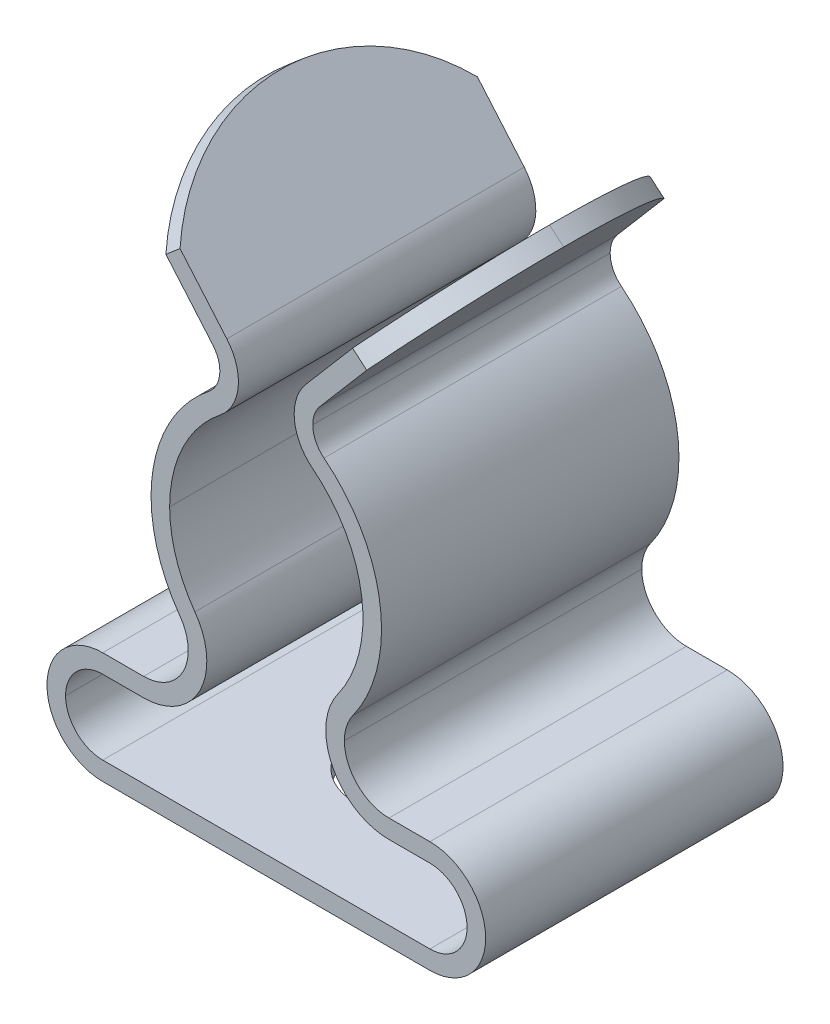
ISO-10303-21;
HEADER;
FILE_DESCRIPTION(('STEP AP214'),'2;1');
FILE_NAME('part.step','',(''),(''),'','','');
FILE_SCHEMA(('AUTOMOTIVE_DESIGN { 1 0 10303 214 1 1 1 1 }'));
ENDSEC;
DATA;
#1=APPLICATION_CONTEXT('core data for automotive mechanical design processes');
#2=APPLICATION_PROTOCOL_DEFINITION('international standard','automotive_design',2000,#1);
#3=PRODUCT_CONTEXT('',#1,'mechanical');
#4=PRODUCT('Part','Part','',(#3));
#5=PRODUCT_RELATED_PRODUCT_CATEGORY('part','',(#4));
#6=PRODUCT_DEFINITION_FORMATION('','',#4);
#7=PRODUCT_DEFINITION_CONTEXT('part definition',#1,'design');
#8=PRODUCT_DEFINITION('design','',#6,#7);
#9=PRODUCT_DEFINITION_SHAPE('','',#8);
#10=(LENGTH_UNIT() NAMED_UNIT(*) SI_UNIT(.MILLI.,.METRE.));
#11=(NAMED_UNIT(*) PLANE_ANGLE_UNIT() SI_UNIT($,.RADIAN.));
#12=(NAMED_UNIT(*) SI_UNIT($,.STERADIAN.) SOLID_ANGLE_UNIT());
#13=UNCERTAINTY_MEASURE_WITH_UNIT(LENGTH_MEASURE(1.E-05),#10,'distance_accuracy_value','');
#14=(GEOMETRIC_REPRESENTATION_CONTEXT(3) GLOBAL_UNCERTAINTY_ASSIGNED_CONTEXT((#13)) GLOBAL_UNIT_ASSIGNED_CONTEXT((#10,
#11,#12)) REPRESENTATION_CONTEXT('',''));
#15=CARTESIAN_POINT('',(0.,0.,0.));
#16=DIRECTION('',(0.,0.,1.));
#17=DIRECTION('',(1.,0.,0.));
#18=AXIS2_PLACEMENT_3D('',#15,#16,#17);
#19=CARTESIAN_POINT('',(0.,0.,4.));
#20=DIRECTION('',(0.,-1.,0.));
#21=DIRECTION('',(0.,0.,-1.));
#22=AXIS2_PLACEMENT_3D('',#19,#20,#21);
#23=CYLINDRICAL_SURFACE('',#22,1.6);
#24=DIRECTION('',(0.,-1.,0.));
#25=VECTOR('',#24,1.);
#26=CARTESIAN_POINT('',(0.,0.,5.6));
#27=LINE('',#26,#25);
#28=CARTESIAN_POINT('',(0.,0.5,5.6));
#29=VERTEX_POINT('',#28);
#30=CARTESIAN_POINT('',(0.,0.,5.6));
#31=VERTEX_POINT('',#30);
#32=EDGE_CURVE('E355',#29,#31,#27,.T.);
#33=ORIENTED_EDGE('',*,*,#32,.F.);
#34=CARTESIAN_POINT('',(0.,0.5,4.));
#35=DIRECTION('',(0.,1.,0.));
#36=DIRECTION('',(0.,0.,1.));
#37=AXIS2_PLACEMENT_3D('',#34,#35,#36);
#38=CIRCLE('',#37,1.6);
#39=CARTESIAN_POINT('',(0.,0.5,2.4));
#40=VERTEX_POINT('',#39);
#41=EDGE_CURVE('E350',#29,#40,#38,.T.);
#42=ORIENTED_EDGE('',*,*,#41,.T.);
#43=DIRECTION('',(0.,-1.,0.));
#44=VECTOR('',#43,1.);
#45=CARTESIAN_POINT('',(0.,0.,2.4));
#46=LINE('',#45,#44);
#47=CARTESIAN_POINT('',(0.,0.,2.4));
#48=VERTEX_POINT('',#47);
#49=EDGE_CURVE('E352',#40,#48,#46,.T.);
#50=ORIENTED_EDGE('',*,*,#49,.T.);
#51=CARTESIAN_POINT('',(0.,0.,4.));
#52=DIRECTION('',(0.,-1.,0.));
#53=DIRECTION('',(0.,0.,-1.));
#54=AXIS2_PLACEMENT_3D('',#51,#52,#53);
#55=CIRCLE('',#54,1.6);
#56=EDGE_CURVE('E772',#48,#31,#55,.T.);
#57=ORIENTED_EDGE('',*,*,#56,.T.);
#58=EDGE_LOOP('',(#33,#42,#50,#57));
#59=FACE_BOUND('',#58,.T.);
#60=ADVANCED_FACE('F15',(#59),#23,.F.);
#61=CARTESIAN_POINT('',(5.13195390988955,15.8764094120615,4.));
#62=DIRECTION('',(-0.76040596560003,-0.649448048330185,0.));
#63=DIRECTION('',(0.649448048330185,-0.76040596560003,0.));
#64=AXIS2_PLACEMENT_3D('',#61,#62,#63);
#65=CYLINDRICAL_SURFACE('',#64,5.);
#66=CARTESIAN_POINT('',(-0.372556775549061,11.1751131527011,4.));
#67=DIRECTION('',(-0.76040596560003,-0.649448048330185,0.));
#68=DIRECTION('',(-0.649448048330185,0.76040596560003,0.));
#69=AXIS2_PLACEMENT_3D('',#66,#67,#68);
#70=CIRCLE('',#69,5.);
#71=CARTESIAN_POINT('',(-2.32090092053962,13.4563310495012,8.));
#72=VERTEX_POINT('',#71);
#73=CARTESIAN_POINT('',(-2.32090092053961,13.4563310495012,0.));
#74=VERTEX_POINT('',#73);
#75=EDGE_CURVE('E436',#72,#74,#70,.T.);
#76=ORIENTED_EDGE('',*,*,#75,.T.);
#77=DIRECTION('',(-0.76040596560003,-0.649448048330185,0.));
#78=VECTOR('',#77,1.);
#79=CARTESIAN_POINT('',(3.18360976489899,18.1576273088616,0.));
#80=LINE('',#79,#78);
#81=CARTESIAN_POINT('',(-2.70110390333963,13.1316070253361,0.));
#82=VERTEX_POINT('',#81);
#83=EDGE_CURVE('E722',#74,#82,#80,.T.);
#84=ORIENTED_EDGE('',*,*,#83,.T.);
#85=CARTESIAN_POINT('',(-0.752759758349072,10.850389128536,4.));
#86=DIRECTION('',(0.76040596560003,0.649448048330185,0.));
#87=DIRECTION('',(0.649448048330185,-0.76040596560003,0.));
#88=AXIS2_PLACEMENT_3D('',#85,#86,#87);
#89=CIRCLE('',#88,5.);
#90=CARTESIAN_POINT('',(-2.70110390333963,13.1316070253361,8.));
#91=VERTEX_POINT('',#90);
#92=EDGE_CURVE('E630',#82,#91,#89,.T.);
#93=ORIENTED_EDGE('',*,*,#92,.T.);
#94=DIRECTION('',(-0.76040596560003,-0.649448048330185,0.));
#95=VECTOR('',#94,1.);
#96=CARTESIAN_POINT('',(3.18360976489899,18.1576273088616,8.));
#97=LINE('',#96,#95);
#98=EDGE_CURVE('E477',#72,#91,#97,.T.);
#99=ORIENTED_EDGE('',*,*,#98,.F.);
#100=EDGE_LOOP('',(#76,#84,#93,#99));
#101=FACE_BOUND('',#100,.T.);
#102=ADVANCED_FACE('F842',(#101),#65,.T.);
#103=CARTESIAN_POINT('',(-5.13195390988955,15.8764094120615,4.));
#104=DIRECTION('',(0.76040596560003,-0.649448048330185,0.));
#105=DIRECTION('',(0.649448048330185,0.76040596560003,0.));
#106=AXIS2_PLACEMENT_3D('',#103,#104,#105);
#107=CYLINDRICAL_SURFACE('',#106,5.);
#108=DIRECTION('',(0.76040596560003,-0.649448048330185,0.));
#109=VECTOR('',#108,1.);
#110=CARTESIAN_POINT('',(-1.88471366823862,19.6784392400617,4.));
#111=LINE('',#110,#109);
#112=CARTESIAN_POINT('',(3.61979701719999,14.9771429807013,4.));
#113=VERTEX_POINT('',#112);
#114=CARTESIAN_POINT('',(4.,14.6524189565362,4.));
#115=VERTEX_POINT('',#114);
#116=EDGE_CURVE('E410',#113,#115,#111,.T.);
#117=ORIENTED_EDGE('',*,*,#116,.F.);
#118=CARTESIAN_POINT('',(0.372556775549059,11.1751131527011,4.));
#119=DIRECTION('',(0.76040596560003,-0.649448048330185,0.));
#120=DIRECTION('',(-0.649448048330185,-0.76040596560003,0.));
#121=AXIS2_PLACEMENT_3D('',#118,#119,#120);
#122=CIRCLE('',#121,5.);
#123=CARTESIAN_POINT('',(2.32090092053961,13.4563310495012,8.));
#124=VERTEX_POINT('',#123);
#125=EDGE_CURVE('E719',#113,#124,#122,.T.);
#126=ORIENTED_EDGE('',*,*,#125,.T.);
#127=DIRECTION('',(0.76040596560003,-0.649448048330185,0.));
#128=VECTOR('',#127,1.);
#129=CARTESIAN_POINT('',(-3.18360976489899,18.1576273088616,8.));
#130=LINE('',#129,#128);
#131=CARTESIAN_POINT('',(2.70110390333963,13.1316070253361,8.));
#132=VERTEX_POINT('',#131);
#133=EDGE_CURVE('E554',#124,#132,#130,.T.);
#134=ORIENTED_EDGE('',*,*,#133,.T.);
#135=CARTESIAN_POINT('',(0.752759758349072,10.850389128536,4.));
#136=DIRECTION('',(-0.76040596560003,0.649448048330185,0.));
#137=DIRECTION('',(-0.649448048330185,-0.76040596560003,0.));
#138=AXIS2_PLACEMENT_3D('',#135,#136,#137);
#139=CIRCLE('',#138,5.);
#140=EDGE_CURVE('E709',#132,#115,#139,.T.);
#141=ORIENTED_EDGE('',*,*,#140,.T.);
#142=EDGE_LOOP('',(#117,#126,#134,#141));
#143=FACE_BOUND('',#142,.T.);
#144=ADVANCED_FACE('F930',(#143),#107,.T.);
#145=CARTESIAN_POINT('',(2.05,11.1374470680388,8.));
#146=DIRECTION('',(0.,0.,-1.));
#147=DIRECTION('',(-1.,0.,0.));
#148=AXIS2_PLACEMENT_3D('',#145,#146,#147);
#149=CYLINDRICAL_SURFACE('',#148,0.8);
#150=DIRECTION('',(0.,0.,-1.));
#151=VECTOR('',#150,1.);
#152=CARTESIAN_POINT('',(1.25,11.1374470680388,8.));
#153=LINE('',#152,#151);
#154=CARTESIAN_POINT('',(1.25,11.1374470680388,8.));
#155=VERTEX_POINT('',#154);
#156=CARTESIAN_POINT('',(1.25,11.1374470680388,0.));
#157=VERTEX_POINT('',#156);
#158=EDGE_CURVE('E390',#155,#157,#153,.T.);
#159=ORIENTED_EDGE('',*,*,#158,.F.);
#160=CARTESIAN_POINT('',(2.05,11.1374470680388,8.));
#161=DIRECTION('',(0.,0.,-1.));
#162=DIRECTION('',(-1.,0.,0.));
#163=AXIS2_PLACEMENT_3D('',#160,#161,#162);
#164=CIRCLE('',#163,0.8);
#165=CARTESIAN_POINT('',(1.55173292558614,10.5115637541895,8.));
#166=VERTEX_POINT('',#165);
#167=EDGE_CURVE('E555',#166,#155,#164,.T.);
#168=ORIENTED_EDGE('',*,*,#167,.F.);
#169=DIRECTION('',(0.,0.,-1.));
#170=VECTOR('',#169,1.);
#171=CARTESIAN_POINT('',(1.55173292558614,10.5115637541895,8.));
#172=LINE('',#171,#170);
#173=CARTESIAN_POINT('',(1.55173292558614,10.5115637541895,0.));
#174=VERTEX_POINT('',#173);
#175=EDGE_CURVE('E9',#166,#174,#172,.T.);
#176=ORIENTED_EDGE('',*,*,#175,.T.);
#177=CARTESIAN_POINT('',(2.05,11.1374470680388,0.));
#178=DIRECTION('',(0.,0.,-1.));
#179=DIRECTION('',(-1.,0.,0.));
#180=AXIS2_PLACEMENT_3D('',#177,#178,#179);
#181=CIRCLE('',#180,0.8);
#182=EDGE_CURVE('E740',#174,#157,#181,.T.);
#183=ORIENTED_EDGE('',*,*,#182,.T.);
#184=EDGE_LOOP('',(#159,#168,#176,#183));
#185=FACE_BOUND('',#184,.T.);
#186=ADVANCED_FACE('F919',(#185),#149,.F.);
#187=CARTESIAN_POINT('',(-1.005,7.3,8.));
#188=DIRECTION('',(0.,0.,-1.));
#189=DIRECTION('',(-1.,0.,0.));
#190=AXIS2_PLACEMENT_3D('',#187,#188,#189);
#191=CYLINDRICAL_SURFACE('',#190,4.105);
#192=CARTESIAN_POINT('',(-1.005,7.3,0.));
#193=DIRECTION('',(0.,0.,1.));
#194=DIRECTION('',(1.,0.,0.));
#195=AXIS2_PLACEMENT_3D('',#192,#193,#194);
#196=CIRCLE('',#195,4.105);
#197=CARTESIAN_POINT('',(2.32620169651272,4.90122525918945,0.));
#198=VERTEX_POINT('',#197);
#199=EDGE_CURVE('E743',#198,#174,#196,.T.);
#200=ORIENTED_EDGE('',*,*,#199,.T.);
#201=ORIENTED_EDGE('',*,*,#175,.F.);
#202=CARTESIAN_POINT('',(-1.005,7.3,8.));
#203=DIRECTION('',(0.,0.,1.));
#204=DIRECTION('',(1.,0.,0.));
#205=AXIS2_PLACEMENT_3D('',#202,#203,#204);
#206=CIRCLE('',#205,4.105);
#207=CARTESIAN_POINT('',(2.32620169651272,4.90122525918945,8.));
#208=VERTEX_POINT('',#207);
#209=EDGE_CURVE('E535',#208,#166,#206,.T.);
#210=ORIENTED_EDGE('',*,*,#209,.F.);
#211=DIRECTION('',(0.,0.,-1.));
#212=VECTOR('',#211,1.);
#213=CARTESIAN_POINT('',(2.32620169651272,4.90122525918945,8.));
#214=LINE('',#213,#212);
#215=EDGE_CURVE('E445',#208,#198,#214,.T.);
#216=ORIENTED_EDGE('',*,*,#215,.T.);
#217=EDGE_LOOP('',(#200,#201,#210,#216));
#218=FACE_BOUND('',#217,.T.);
#219=ADVANCED_FACE('F921',(#218),#191,.T.);
#220=CARTESIAN_POINT('',(3.3,4.2,8.));
#221=DIRECTION('',(0.,0.,-1.));
#222=DIRECTION('',(-1.,0.,0.));
#223=AXIS2_PLACEMENT_3D('',#220,#221,#222);
#224=CYLINDRICAL_SURFACE('',#223,1.2);
#225=DIRECTION('',(0.,0.,-1.));
#226=VECTOR('',#225,1.);
#227=CARTESIAN_POINT('',(2.1,4.2,8.));
#228=LINE('',#227,#226);
#229=CARTESIAN_POINT('',(2.1,4.2,8.));
#230=VERTEX_POINT('',#229);
#231=CARTESIAN_POINT('',(2.1,4.2,0.));
#232=VERTEX_POINT('',#231);
#233=EDGE_CURVE('E420',#230,#232,#228,.T.);
#234=ORIENTED_EDGE('',*,*,#233,.F.);
#235=CARTESIAN_POINT('',(3.3,4.2,8.));
#236=DIRECTION('',(0.,0.,-1.));
#237=DIRECTION('',(-1.,0.,0.));
#238=AXIS2_PLACEMENT_3D('',#235,#236,#237);
#239=CIRCLE('',#238,1.2);
#240=CARTESIAN_POINT('',(3.3,3.,8.));
#241=VERTEX_POINT('',#240);
#242=EDGE_CURVE('E528',#241,#230,#239,.T.);
#243=ORIENTED_EDGE('',*,*,#242,.F.);
#244=DIRECTION('',(0.,0.,-1.));
#245=VECTOR('',#244,1.);
#246=CARTESIAN_POINT('',(3.3,3.,8.));
#247=LINE('',#246,#245);
#248=CARTESIAN_POINT('',(3.3,3.,0.));
#249=VERTEX_POINT('',#248);
#250=EDGE_CURVE('E18',#241,#249,#247,.T.);
#251=ORIENTED_EDGE('',*,*,#250,.T.);
#252=CARTESIAN_POINT('',(3.3,4.2,0.));
#253=DIRECTION('',(0.,0.,-1.));
#254=DIRECTION('',(-1.,0.,0.));
#255=AXIS2_PLACEMENT_3D('',#252,#253,#254);
#256=CIRCLE('',#255,1.2);
#257=EDGE_CURVE('E431',#249,#232,#256,.T.);
#258=ORIENTED_EDGE('',*,*,#257,.T.);
#259=EDGE_LOOP('',(#234,#243,#251,#258));
#260=FACE_BOUND('',#259,.T.);
#261=ADVANCED_FACE('F785',(#260),#224,.F.);
#262=CARTESIAN_POINT('',(4.4,3.,8.));
#263=DIRECTION('',(0.,-1.,0.));
#264=DIRECTION('',(-1.,0.,0.));
#265=AXIS2_PLACEMENT_3D('',#262,#263,#264);
#266=PLANE('',#265);
#267=DIRECTION('',(-1.,0.,0.));
#268=VECTOR('',#267,1.);
#269=CARTESIAN_POINT('',(4.4,3.,0.));
#270=LINE('',#269,#268);
#271=CARTESIAN_POINT('',(4.4,3.,0.));
#272=VERTEX_POINT('',#271);
#273=EDGE_CURVE('E426',#272,#249,#270,.T.);
#274=ORIENTED_EDGE('',*,*,#273,.T.);
#275=ORIENTED_EDGE('',*,*,#250,.F.);
#276=DIRECTION('',(-1.,0.,0.));
#277=VECTOR('',#276,1.);
#278=CARTESIAN_POINT('',(4.4,3.,8.));
#279=LINE('',#278,#277);
#280=CARTESIAN_POINT('',(4.4,3.,8.));
#281=VERTEX_POINT('',#280);
#282=EDGE_CURVE('E519',#281,#241,#279,.T.);
#283=ORIENTED_EDGE('',*,*,#282,.F.);
#284=DIRECTION('',(0.,0.,-1.));
#285=VECTOR('',#284,1.);
#286=CARTESIAN_POINT('',(4.4,3.,8.));
#287=LINE('',#286,#285);
#288=EDGE_CURVE('E774',#281,#272,#287,.T.);
#289=ORIENTED_EDGE('',*,*,#288,.T.);
#290=EDGE_LOOP('',(#274,#275,#283,#289));
#291=FACE_BOUND('',#290,.T.);
#292=ADVANCED_FACE('F789',(#291),#266,.F.);
#293=CARTESIAN_POINT('',(4.4,1.5,8.));
#294=DIRECTION('',(0.,0.,-1.));
#295=DIRECTION('',(-1.,0.,0.));
#296=AXIS2_PLACEMENT_3D('',#293,#294,#295);
#297=CYLINDRICAL_SURFACE('',#296,1.5);
#298=CARTESIAN_POINT('',(4.4,1.5,0.));
#299=DIRECTION('',(0.,0.,1.));
#300=DIRECTION('',(1.,0.,0.));
#301=AXIS2_PLACEMENT_3D('',#298,#299,#300);
#302=CIRCLE('',#301,1.5);
#303=CARTESIAN_POINT('',(4.4,0.,0.));
#304=VERTEX_POINT('',#303);
#305=EDGE_CURVE('E430',#304,#272,#302,.T.);
#306=ORIENTED_EDGE('',*,*,#305,.T.);
#307=ORIENTED_EDGE('',*,*,#288,.F.);
#308=CARTESIAN_POINT('',(4.4,1.5,8.));
#309=DIRECTION('',(0.,0.,1.));
#310=DIRECTION('',(1.,0.,0.));
#311=AXIS2_PLACEMENT_3D('',#308,#309,#310);
#312=CIRCLE('',#311,1.5);
#313=CARTESIAN_POINT('',(4.4,0.,8.));
#314=VERTEX_POINT('',#313);
#315=EDGE_CURVE('E515',#314,#281,#312,.T.);
#316=ORIENTED_EDGE('',*,*,#315,.F.);
#317=DIRECTION('',(0.,0.,-1.));
#318=VECTOR('',#317,1.);
#319=CARTESIAN_POINT('',(4.4,0.,8.));
#320=LINE('',#319,#318);
#321=EDGE_CURVE('E489',#314,#304,#320,.T.);
#322=ORIENTED_EDGE('',*,*,#321,.T.);
#323=EDGE_LOOP('',(#306,#307,#316,#322));
#324=FACE_BOUND('',#323,.T.);
#325=ADVANCED_FACE('F804',(#324),#297,.T.);
#326=CARTESIAN_POINT('',(4.4,0.,8.));
#327=DIRECTION('',(0.,1.,0.));
#328=DIRECTION('',(1.,0.,0.));
#329=AXIS2_PLACEMENT_3D('',#326,#327,#328);
#330=PLANE('',#329);
#331=ORIENTED_EDGE('',*,*,#56,.F.);
#332=CARTESIAN_POINT('',(0.,0.,4.));
#333=DIRECTION('',(0.,-1.,0.));
#334=DIRECTION('',(0.,0.,-1.));
#335=AXIS2_PLACEMENT_3D('',#332,#333,#334);
#336=CIRCLE('',#335,1.6);
#337=EDGE_CURVE('E367',#31,#48,#336,.T.);
#338=ORIENTED_EDGE('',*,*,#337,.F.);
#339=EDGE_LOOP('',(#331,#338));
#340=FACE_BOUND('',#339,.T.);
#341=DIRECTION('',(1.,0.,0.));
#342=VECTOR('',#341,1.);
#343=CARTESIAN_POINT('',(4.4,0.,0.));
#344=LINE('',#343,#342);
#345=CARTESIAN_POINT('',(-4.4,0.,0.));
#346=VERTEX_POINT('',#345);
#347=EDGE_CURVE('E752',#346,#304,#344,.T.);
#348=ORIENTED_EDGE('',*,*,#347,.T.);
#349=ORIENTED_EDGE('',*,*,#321,.F.);
#350=DIRECTION('',(1.,0.,0.));
#351=VECTOR('',#350,1.);
#352=CARTESIAN_POINT('',(4.4,0.,8.));
#353=LINE('',#352,#351);
#354=CARTESIAN_POINT('',(-4.4,0.,8.));
#355=VERTEX_POINT('',#354);
#356=EDGE_CURVE('E520',#355,#314,#353,.T.);
#357=ORIENTED_EDGE('',*,*,#356,.F.);
#358=DIRECTION('',(0.,0.,-1.));
#359=VECTOR('',#358,1.);
#360=CARTESIAN_POINT('',(-4.4,0.,8.));
#361=LINE('',#360,#359);
#362=EDGE_CURVE('E457',#355,#346,#361,.T.);
#363=ORIENTED_EDGE('',*,*,#362,.T.);
#364=EDGE_LOOP('',(#348,#349,#357,#363));
#365=FACE_BOUND('',#364,.T.);
#366=ADVANCED_FACE('F809',(#340,#365),#330,.F.);
#367=CARTESIAN_POINT('',(-4.4,1.5,8.));
#368=DIRECTION('',(0.,0.,-1.));
#369=DIRECTION('',(-1.,0.,0.));
#370=AXIS2_PLACEMENT_3D('',#367,#368,#369);
#371=CYLINDRICAL_SURFACE('',#370,1.5);
#372=DIRECTION('',(0.,0.,-1.));
#373=VECTOR('',#372,1.);
#374=CARTESIAN_POINT('',(-5.9,1.5,8.));
#375=LINE('',#374,#373);
#376=CARTESIAN_POINT('',(-5.9,1.5,8.));
#377=VERTEX_POINT('',#376);
#378=CARTESIAN_POINT('',(-5.9,1.5,0.));
#379=VERTEX_POINT('',#378);
#380=EDGE_CURVE('E481',#377,#379,#375,.T.);
#381=ORIENTED_EDGE('',*,*,#380,.F.);
#382=CARTESIAN_POINT('',(-4.4,1.5,8.));
#383=DIRECTION('',(0.,0.,1.));
#384=DIRECTION('',(-1.,0.,0.));
#385=AXIS2_PLACEMENT_3D('',#382,#383,#384);
#386=CIRCLE('',#385,1.5);
#387=CARTESIAN_POINT('',(-4.4,3.,8.));
#388=VERTEX_POINT('',#387);
#389=EDGE_CURVE('E657',#388,#377,#386,.T.);
#390=ORIENTED_EDGE('',*,*,#389,.F.);
#391=DIRECTION('',(0.,0.,-1.));
#392=VECTOR('',#391,1.);
#393=CARTESIAN_POINT('',(-4.4,3.,8.));
#394=LINE('',#393,#392);
#395=CARTESIAN_POINT('',(-4.4,3.,0.));
#396=VERTEX_POINT('',#395);
#397=EDGE_CURVE('E486',#388,#396,#394,.T.);
#398=ORIENTED_EDGE('',*,*,#397,.T.);
#399=CARTESIAN_POINT('',(-4.4,1.5,0.));
#400=DIRECTION('',(0.,0.,1.));
#401=DIRECTION('',(-1.,0.,0.));
#402=AXIS2_PLACEMENT_3D('',#399,#400,#401);
#403=CIRCLE('',#402,1.5);
#404=EDGE_CURVE('E756',#396,#379,#403,.T.);
#405=ORIENTED_EDGE('',*,*,#404,.T.);
#406=EDGE_LOOP('',(#381,#390,#398,#405));
#407=FACE_BOUND('',#406,.T.);
#408=ADVANCED_FACE('F816',(#407),#371,.T.);
#409=CARTESIAN_POINT('',(-4.4,3.,8.));
#410=DIRECTION('',(0.,-1.,0.));
#411=DIRECTION('',(0.,0.,-1.));
#412=AXIS2_PLACEMENT_3D('',#409,#410,#411);
#413=PLANE('',#412);
#414=DIRECTION('',(-1.,0.,0.));
#415=VECTOR('',#414,1.);
#416=CARTESIAN_POINT('',(-4.4,3.,0.));
#417=LINE('',#416,#415);
#418=CARTESIAN_POINT('',(-3.3,3.,0.));
#419=VERTEX_POINT('',#418);
#420=EDGE_CURVE('E759',#419,#396,#417,.T.);
#421=ORIENTED_EDGE('',*,*,#420,.T.);
#422=ORIENTED_EDGE('',*,*,#397,.F.);
#423=DIRECTION('',(-1.,0.,0.));
#424=VECTOR('',#423,1.);
#425=CARTESIAN_POINT('',(-4.4,3.,8.));
#426=LINE('',#425,#424);
#427=CARTESIAN_POINT('',(-3.3,3.,8.));
#428=VERTEX_POINT('',#427);
#429=EDGE_CURVE('E653',#428,#388,#426,.T.);
#430=ORIENTED_EDGE('',*,*,#429,.F.);
#431=DIRECTION('',(0.,0.,-1.));
#432=VECTOR('',#431,1.);
#433=CARTESIAN_POINT('',(-3.3,3.,8.));
#434=LINE('',#433,#432);
#435=EDGE_CURVE('E45',#428,#419,#434,.T.);
#436=ORIENTED_EDGE('',*,*,#435,.T.);
#437=EDGE_LOOP('',(#421,#422,#430,#436));
#438=FACE_BOUND('',#437,.T.);
#439=ADVANCED_FACE('F819',(#438),#413,.F.);
#440=CARTESIAN_POINT('',(-3.3,4.2,8.));
#441=DIRECTION('',(0.,0.,-1.));
#442=DIRECTION('',(-1.,0.,0.));
#443=AXIS2_PLACEMENT_3D('',#440,#441,#442);
#444=CYLINDRICAL_SURFACE('',#443,1.2);
#445=CARTESIAN_POINT('',(-3.3,4.2,0.));
#446=DIRECTION('',(0.,0.,-1.));
#447=DIRECTION('',(1.,0.,0.));
#448=AXIS2_PLACEMENT_3D('',#445,#446,#447);
#449=CIRCLE('',#448,1.2);
#450=CARTESIAN_POINT('',(-2.32620169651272,4.90122525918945,0.));
#451=VERTEX_POINT('',#450);
#452=EDGE_CURVE('E675',#451,#419,#449,.T.);
#453=ORIENTED_EDGE('',*,*,#452,.T.);
#454=ORIENTED_EDGE('',*,*,#435,.F.);
#455=CARTESIAN_POINT('',(-3.3,4.2,8.));
#456=DIRECTION('',(0.,0.,-1.));
#457=DIRECTION('',(1.,0.,0.));
#458=AXIS2_PLACEMENT_3D('',#455,#456,#457);
#459=CIRCLE('',#458,1.2);
#460=CARTESIAN_POINT('',(-2.32620169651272,4.90122525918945,8.));
#461=VERTEX_POINT('',#460);
#462=EDGE_CURVE('E498',#461,#428,#459,.T.);
#463=ORIENTED_EDGE('',*,*,#462,.F.);
#464=DIRECTION('',(0.,0.,-1.));
#465=VECTOR('',#464,1.);
#466=CARTESIAN_POINT('',(-2.32620169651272,4.90122525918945,8.));
#467=LINE('',#466,#465);
#468=EDGE_CURVE('E506',#461,#451,#467,.T.);
#469=ORIENTED_EDGE('',*,*,#468,.T.);
#470=EDGE_LOOP('',(#453,#454,#463,#469));
#471=FACE_BOUND('',#470,.T.);
#472=ADVANCED_FACE('F823',(#471),#444,.F.);
#473=CARTESIAN_POINT('',(1.005,7.3,8.));
#474=DIRECTION('',(0.,0.,-1.));
#475=DIRECTION('',(-1.,0.,0.));
#476=AXIS2_PLACEMENT_3D('',#473,#474,#475);
#477=CYLINDRICAL_SURFACE('',#476,4.105);
#478=DIRECTION('',(0.,0.,-1.));
#479=VECTOR('',#478,1.);
#480=CARTESIAN_POINT('',(-3.1,7.3,8.));
#481=LINE('',#480,#479);
#482=CARTESIAN_POINT('',(-3.1,7.3,8.));
#483=VERTEX_POINT('',#482);
#484=CARTESIAN_POINT('',(-3.1,7.3,0.));
#485=VERTEX_POINT('',#484);
#486=EDGE_CURVE('E456',#483,#485,#481,.T.);
#487=ORIENTED_EDGE('',*,*,#486,.F.);
#488=CARTESIAN_POINT('',(1.005,7.3,8.));
#489=DIRECTION('',(0.,0.,1.));
#490=DIRECTION('',(-1.,0.,0.));
#491=AXIS2_PLACEMENT_3D('',#488,#489,#490);
#492=CIRCLE('',#491,4.105);
#493=CARTESIAN_POINT('',(-1.55173292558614,10.5115637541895,8.));
#494=VERTEX_POINT('',#493);
#495=EDGE_CURVE('E476',#494,#483,#492,.T.);
#496=ORIENTED_EDGE('',*,*,#495,.F.);
#497=DIRECTION('',(0.,0.,-1.));
#498=VECTOR('',#497,1.);
#499=CARTESIAN_POINT('',(-1.55173292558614,10.5115637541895,8.));
#500=LINE('',#499,#498);
#501=CARTESIAN_POINT('',(-1.55173292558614,10.5115637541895,0.));
#502=VERTEX_POINT('',#501);
#503=EDGE_CURVE('E35',#494,#502,#500,.T.);
#504=ORIENTED_EDGE('',*,*,#503,.T.);
#505=CARTESIAN_POINT('',(1.005,7.3,0.));
#506=DIRECTION('',(0.,0.,1.));
#507=DIRECTION('',(-1.,0.,0.));
#508=AXIS2_PLACEMENT_3D('',#505,#506,#507);
#509=CIRCLE('',#508,4.105);
#510=EDGE_CURVE('E671',#502,#485,#509,.T.);
#511=ORIENTED_EDGE('',*,*,#510,.T.);
#512=EDGE_LOOP('',(#487,#496,#504,#511));
#513=FACE_BOUND('',#512,.T.);
#514=ADVANCED_FACE('F828',(#513),#477,.T.);
#515=CARTESIAN_POINT('',(-2.05,11.1374470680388,8.));
#516=DIRECTION('',(0.,0.,-1.));
#517=DIRECTION('',(-1.,0.,0.));
#518=AXIS2_PLACEMENT_3D('',#515,#516,#517);
#519=CYLINDRICAL_SURFACE('',#518,0.8);
#520=CARTESIAN_POINT('',(-2.05,11.1374470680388,0.));
#521=DIRECTION('',(0.,0.,-1.));
#522=DIRECTION('',(1.,0.,0.));
#523=AXIS2_PLACEMENT_3D('',#520,#521,#522);
#524=CIRCLE('',#523,0.8);
#525=CARTESIAN_POINT('',(-1.44167522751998,11.657005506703,0.));
#526=VERTEX_POINT('',#525);
#527=EDGE_CURVE('E674',#526,#502,#524,.T.);
#528=ORIENTED_EDGE('',*,*,#527,.T.);
#529=ORIENTED_EDGE('',*,*,#503,.F.);
#530=CARTESIAN_POINT('',(-2.05,11.1374470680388,8.));
#531=DIRECTION('',(0.,0.,-1.));
#532=DIRECTION('',(1.,0.,0.));
#533=AXIS2_PLACEMENT_3D('',#530,#531,#532);
#534=CIRCLE('',#533,0.8);
#535=CARTESIAN_POINT('',(-1.44167522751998,11.657005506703,8.));
#536=VERTEX_POINT('',#535);
#537=EDGE_CURVE('E472',#536,#494,#534,.T.);
#538=ORIENTED_EDGE('',*,*,#537,.F.);
#539=DIRECTION('',(0.,0.,-1.));
#540=VECTOR('',#539,1.);
#541=CARTESIAN_POINT('',(-1.44167522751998,11.657005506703,8.));
#542=LINE('',#541,#540);
#543=EDGE_CURVE('E642',#536,#526,#542,.T.);
#544=ORIENTED_EDGE('',*,*,#543,.T.);
#545=EDGE_LOOP('',(#528,#529,#538,#544));
#546=FACE_BOUND('',#545,.T.);
#547=ADVANCED_FACE('F832',(#546),#519,.F.);
#548=CARTESIAN_POINT('',(-2.05,11.1374470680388,8.));
#549=DIRECTION('',(0.,0.,-1.));
#550=DIRECTION('',(-1.,0.,0.));
#551=AXIS2_PLACEMENT_3D('',#548,#549,#550);
#552=CYLINDRICAL_SURFACE('',#551,1.3);
#553=CARTESIAN_POINT('',(-2.05,11.1374470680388,0.));
#554=DIRECTION('',(0.,0.,-1.));
#555=DIRECTION('',(1.,0.,0.));
#556=AXIS2_PLACEMENT_3D('',#553,#554,#555);
#557=CIRCLE('',#556,1.3);
#558=CARTESIAN_POINT('',(-1.06147224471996,11.9817295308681,0.));
#559=VERTEX_POINT('',#558);
#560=CARTESIAN_POINT('',(-1.24031600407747,10.1203866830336,0.));
#561=VERTEX_POINT('',#560);
#562=EDGE_CURVE('E549',#559,#561,#557,.T.);
#563=ORIENTED_EDGE('',*,*,#562,.F.);
#564=DIRECTION('',(0.,0.,-1.));
#565=VECTOR('',#564,1.);
#566=CARTESIAN_POINT('',(-1.06147224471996,11.9817295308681,8.));
#567=LINE('',#566,#565);
#568=CARTESIAN_POINT('',(-1.06147224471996,11.9817295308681,8.));
#569=VERTEX_POINT('',#568);
#570=EDGE_CURVE('E618',#569,#559,#567,.T.);
#571=ORIENTED_EDGE('',*,*,#570,.F.);
#572=CARTESIAN_POINT('',(-2.05,11.1374470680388,8.));
#573=DIRECTION('',(0.,0.,-1.));
#574=DIRECTION('',(1.,0.,0.));
#575=AXIS2_PLACEMENT_3D('',#572,#573,#574);
#576=CIRCLE('',#575,1.3);
#577=CARTESIAN_POINT('',(-1.24031600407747,10.1203866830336,8.));
#578=VERTEX_POINT('',#577);
#579=EDGE_CURVE('E703',#569,#578,#576,.T.);
#580=ORIENTED_EDGE('',*,*,#579,.T.);
#581=DIRECTION('',(0.,0.,-1.));
#582=VECTOR('',#581,1.);
#583=CARTESIAN_POINT('',(-1.24031600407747,10.1203866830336,8.));
#584=LINE('',#583,#582);
#585=EDGE_CURVE('E532',#578,#561,#584,.T.);
#586=ORIENTED_EDGE('',*,*,#585,.T.);
#587=EDGE_LOOP('',(#563,#571,#580,#586));
#588=FACE_BOUND('',#587,.T.);
#589=ADVANCED_FACE('F846',(#588),#552,.T.);
#590=CARTESIAN_POINT('',(1.005,7.3,8.));
#591=DIRECTION('',(0.,0.,-1.));
#592=DIRECTION('',(-1.,0.,0.));
#593=AXIS2_PLACEMENT_3D('',#590,#591,#592);
#594=CYLINDRICAL_SURFACE('',#593,3.605);
#595=DIRECTION('',(0.,0.,-1.));
#596=VECTOR('',#595,1.);
#597=CARTESIAN_POINT('',(-2.6,7.3,8.));
#598=LINE('',#597,#596);
#599=CARTESIAN_POINT('',(-2.6,7.3,8.));
#600=VERTEX_POINT('',#599);
#601=CARTESIAN_POINT('',(-2.6,7.3,0.));
#602=VERTEX_POINT('',#601);
#603=EDGE_CURVE('E514',#600,#602,#598,.T.);
#604=ORIENTED_EDGE('',*,*,#603,.F.);
#605=CARTESIAN_POINT('',(1.005,7.3,8.));
#606=DIRECTION('',(0.,0.,1.));
#607=DIRECTION('',(1.,0.,0.));
#608=AXIS2_PLACEMENT_3D('',#605,#606,#607);
#609=CIRCLE('',#608,3.605);
#610=CARTESIAN_POINT('',(-1.92045240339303,5.19340245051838,8.));
#611=VERTEX_POINT('',#610);
#612=EDGE_CURVE('E697',#600,#611,#609,.T.);
#613=ORIENTED_EDGE('',*,*,#612,.T.);
#614=DIRECTION('',(0.,0.,-1.));
#615=VECTOR('',#614,1.);
#616=CARTESIAN_POINT('',(-1.92045240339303,5.19340245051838,8.));
#617=LINE('',#616,#615);
#618=CARTESIAN_POINT('',(-1.92045240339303,5.19340245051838,0.));
#619=VERTEX_POINT('',#618);
#620=EDGE_CURVE('E382',#611,#619,#617,.T.);
#621=ORIENTED_EDGE('',*,*,#620,.T.);
#622=CARTESIAN_POINT('',(1.005,7.3,0.));
#623=DIRECTION('',(0.,0.,1.));
#624=DIRECTION('',(1.,0.,0.));
#625=AXIS2_PLACEMENT_3D('',#622,#623,#624);
#626=CIRCLE('',#625,3.605);
#627=EDGE_CURVE('E544',#602,#619,#626,.T.);
#628=ORIENTED_EDGE('',*,*,#627,.F.);
#629=EDGE_LOOP('',(#604,#613,#621,#628));
#630=FACE_BOUND('',#629,.T.);
#631=ADVANCED_FACE('F852',(#630),#594,.F.);
#632=CARTESIAN_POINT('',(-3.3,4.2,8.));
#633=DIRECTION('',(0.,0.,-1.));
#634=DIRECTION('',(-1.,0.,0.));
#635=AXIS2_PLACEMENT_3D('',#632,#633,#634);
#636=CYLINDRICAL_SURFACE('',#635,1.7);
#637=CARTESIAN_POINT('',(-3.3,4.2,0.));
#638=DIRECTION('',(0.,0.,-1.));
#639=DIRECTION('',(1.,0.,0.));
#640=AXIS2_PLACEMENT_3D('',#637,#638,#639);
#641=CIRCLE('',#640,1.7);
#642=CARTESIAN_POINT('',(-3.3,2.5,0.));
#643=VERTEX_POINT('',#642);
#644=EDGE_CURVE('E548',#619,#643,#641,.T.);
#645=ORIENTED_EDGE('',*,*,#644,.F.);
#646=ORIENTED_EDGE('',*,*,#620,.F.);
#647=CARTESIAN_POINT('',(-3.3,4.2,8.));
#648=DIRECTION('',(0.,0.,-1.));
#649=DIRECTION('',(1.,0.,0.));
#650=AXIS2_PLACEMENT_3D('',#647,#648,#649);
#651=CIRCLE('',#650,1.7);
#652=CARTESIAN_POINT('',(-3.3,2.5,8.));
#653=VERTEX_POINT('',#652);
#654=EDGE_CURVE('E418',#611,#653,#651,.T.);
#655=ORIENTED_EDGE('',*,*,#654,.T.);
#656=DIRECTION('',(0.,0.,-1.));
#657=VECTOR('',#656,1.);
#658=CARTESIAN_POINT('',(-3.3,2.5,8.));
#659=LINE('',#658,#657);
#660=EDGE_CURVE('E360',#653,#643,#659,.T.);
#661=ORIENTED_EDGE('',*,*,#660,.T.);
#662=EDGE_LOOP('',(#645,#646,#655,#661));
#663=FACE_BOUND('',#662,.T.);
#664=ADVANCED_FACE('F856',(#663),#636,.T.);
#665=CARTESIAN_POINT('',(-4.4,2.5,8.));
#666=DIRECTION('',(0.,-1.,0.));
#667=DIRECTION('',(0.,0.,-1.));
#668=AXIS2_PLACEMENT_3D('',#665,#666,#667);
#669=PLANE('',#668);
#670=DIRECTION('',(-1.,0.,0.));
#671=VECTOR('',#670,1.);
#672=CARTESIAN_POINT('',(-4.4,2.5,0.));
#673=LINE('',#672,#671);
#674=CARTESIAN_POINT('',(-4.4,2.5,0.));
#675=VERTEX_POINT('',#674);
#676=EDGE_CURVE('E631',#643,#675,#673,.T.);
#677=ORIENTED_EDGE('',*,*,#676,.F.);
#678=ORIENTED_EDGE('',*,*,#660,.F.);
#679=DIRECTION('',(-1.,0.,0.));
#680=VECTOR('',#679,1.);
#681=CARTESIAN_POINT('',(-4.4,2.5,8.));
#682=LINE('',#681,#680);
#683=CARTESIAN_POINT('',(-4.4,2.5,8.));
#684=VERTEX_POINT('',#683);
#685=EDGE_CURVE('E415',#653,#684,#682,.T.);
#686=ORIENTED_EDGE('',*,*,#685,.T.);
#687=DIRECTION('',(0.,0.,-1.));
#688=VECTOR('',#687,1.);
#689=CARTESIAN_POINT('',(-4.4,2.5,8.));
#690=LINE('',#689,#688);
#691=EDGE_CURVE('E567',#684,#675,#690,.T.);
#692=ORIENTED_EDGE('',*,*,#691,.T.);
#693=EDGE_LOOP('',(#677,#678,#686,#692));
#694=FACE_BOUND('',#693,.T.);
#695=ADVANCED_FACE('F861',(#694),#669,.T.);
#696=CARTESIAN_POINT('',(-4.4,1.5,8.));
#697=DIRECTION('',(0.,0.,-1.));
#698=DIRECTION('',(-1.,0.,0.));
#699=AXIS2_PLACEMENT_3D('',#696,#697,#698);
#700=CYLINDRICAL_SURFACE('',#699,1.);
#701=DIRECTION('',(0.,0.,-1.));
#702=VECTOR('',#701,1.);
#703=CARTESIAN_POINT('',(-5.4,1.5,8.));
#704=LINE('',#703,#702);
#705=CARTESIAN_POINT('',(-5.4,1.5,8.));
#706=VERTEX_POINT('',#705);
#707=CARTESIAN_POINT('',(-5.4,1.5,0.));
#708=VERTEX_POINT('',#707);
#709=EDGE_CURVE('E543',#706,#708,#704,.T.);
#710=ORIENTED_EDGE('',*,*,#709,.F.);
#711=CARTESIAN_POINT('',(-4.4,1.5,8.));
#712=DIRECTION('',(0.,0.,1.));
#713=DIRECTION('',(1.,0.,0.));
#714=AXIS2_PLACEMENT_3D('',#711,#712,#713);
#715=CIRCLE('',#714,1.);
#716=CARTESIAN_POINT('',(-4.4,0.5,8.));
#717=VERTEX_POINT('',#716);
#718=EDGE_CURVE('E419',#706,#717,#715,.T.);
#719=ORIENTED_EDGE('',*,*,#718,.T.);
#720=DIRECTION('',(0.,0.,-1.));
#721=VECTOR('',#720,1.);
#722=CARTESIAN_POINT('',(-4.4,0.5,8.));
#723=LINE('',#722,#721);
#724=CARTESIAN_POINT('',(-4.4,0.5,0.));
#725=VERTEX_POINT('',#724);
#726=EDGE_CURVE('E361',#717,#725,#723,.T.);
#727=ORIENTED_EDGE('',*,*,#726,.T.);
#728=CARTESIAN_POINT('',(-4.4,1.5,0.));
#729=DIRECTION('',(0.,0.,1.));
#730=DIRECTION('',(1.,0.,0.));
#731=AXIS2_PLACEMENT_3D('',#728,#729,#730);
#732=CIRCLE('',#731,1.);
#733=EDGE_CURVE('E634',#708,#725,#732,.T.);
#734=ORIENTED_EDGE('',*,*,#733,.F.);
#735=EDGE_LOOP('',(#710,#719,#727,#734));
#736=FACE_BOUND('',#735,.T.);
#737=ADVANCED_FACE('F868',(#736),#700,.F.);
#738=CARTESIAN_POINT('',(4.4,0.5,8.));
#739=DIRECTION('',(0.,1.,0.));
#740=DIRECTION('',(1.,0.,0.));
#741=AXIS2_PLACEMENT_3D('',#738,#739,#740);
#742=PLANE('',#741);
#743=CARTESIAN_POINT('',(0.,0.5,4.));
#744=DIRECTION('',(0.,1.,0.));
#745=DIRECTION('',(0.,0.,1.));
#746=AXIS2_PLACEMENT_3D('',#743,#744,#745);
#747=CIRCLE('',#746,1.6);
#748=EDGE_CURVE('E365',#40,#29,#747,.T.);
#749=ORIENTED_EDGE('',*,*,#748,.F.);
#750=ORIENTED_EDGE('',*,*,#41,.F.);
#751=EDGE_LOOP('',(#749,#750));
#752=FACE_BOUND('',#751,.T.);
#753=DIRECTION('',(1.,0.,0.));
#754=VECTOR('',#753,1.);
#755=CARTESIAN_POINT('',(4.4,0.5,0.));
#756=LINE('',#755,#754);
#757=CARTESIAN_POINT('',(4.4,0.5,0.));
#758=VERTEX_POINT('',#757);
#759=EDGE_CURVE('E693',#725,#758,#756,.T.);
#760=ORIENTED_EDGE('',*,*,#759,.F.);
#761=ORIENTED_EDGE('',*,*,#726,.F.);
#762=DIRECTION('',(1.,0.,0.));
#763=VECTOR('',#762,1.);
#764=CARTESIAN_POINT('',(4.4,0.5,8.));
#765=LINE('',#764,#763);
#766=CARTESIAN_POINT('',(4.4,0.5,8.));
#767=VERTEX_POINT('',#766);
#768=EDGE_CURVE('E594',#717,#767,#765,.T.);
#769=ORIENTED_EDGE('',*,*,#768,.T.);
#770=DIRECTION('',(0.,0.,-1.));
#771=VECTOR('',#770,1.);
#772=CARTESIAN_POINT('',(4.4,0.5,8.));
#773=LINE('',#772,#771);
#774=EDGE_CURVE('E467',#767,#758,#773,.T.);
#775=ORIENTED_EDGE('',*,*,#774,.T.);
#776=EDGE_LOOP('',(#760,#761,#769,#775));
#777=FACE_BOUND('',#776,.T.);
#778=ADVANCED_FACE('F371',(#752,#777),#742,.T.);
#779=CARTESIAN_POINT('',(4.4,1.5,8.));
#780=DIRECTION('',(0.,0.,-1.));
#781=DIRECTION('',(-1.,0.,0.));
#782=AXIS2_PLACEMENT_3D('',#779,#780,#781);
#783=CYLINDRICAL_SURFACE('',#782,1.);
#784=CARTESIAN_POINT('',(4.4,1.5,0.));
#785=DIRECTION('',(0.,0.,1.));
#786=DIRECTION('',(1.,0.,0.));
#787=AXIS2_PLACEMENT_3D('',#784,#785,#786);
#788=CIRCLE('',#787,1.);
#789=CARTESIAN_POINT('',(4.4,2.5,0.));
#790=VERTEX_POINT('',#789);
#791=EDGE_CURVE('E689',#758,#790,#788,.T.);
#792=ORIENTED_EDGE('',*,*,#791,.F.);
#793=ORIENTED_EDGE('',*,*,#774,.F.);
#794=CARTESIAN_POINT('',(4.4,1.5,8.));
#795=DIRECTION('',(0.,0.,1.));
#796=DIRECTION('',(1.,0.,0.));
#797=AXIS2_PLACEMENT_3D('',#794,#795,#796);
#798=CIRCLE('',#797,1.);
#799=CARTESIAN_POINT('',(4.4,2.5,8.));
#800=VERTEX_POINT('',#799);
#801=EDGE_CURVE('E586',#767,#800,#798,.T.);
#802=ORIENTED_EDGE('',*,*,#801,.T.);
#803=DIRECTION('',(0.,0.,-1.));
#804=VECTOR('',#803,1.);
#805=CARTESIAN_POINT('',(4.4,2.5,8.));
#806=LINE('',#805,#804);
#807=EDGE_CURVE('E464',#800,#790,#806,.T.);
#808=ORIENTED_EDGE('',*,*,#807,.T.);
#809=EDGE_LOOP('',(#792,#793,#802,#808));
#810=FACE_BOUND('',#809,.T.);
#811=ADVANCED_FACE('F874',(#810),#783,.F.);
#812=CARTESIAN_POINT('',(4.4,2.5,8.));
#813=DIRECTION('',(0.,-1.,0.));
#814=DIRECTION('',(-1.,0.,0.));
#815=AXIS2_PLACEMENT_3D('',#812,#813,#814);
#816=PLANE('',#815);
#817=DIRECTION('',(-1.,0.,0.));
#818=VECTOR('',#817,1.);
#819=CARTESIAN_POINT('',(4.4,2.5,0.));
#820=LINE('',#819,#818);
#821=CARTESIAN_POINT('',(3.3,2.5,0.));
#822=VERTEX_POINT('',#821);
#823=EDGE_CURVE('E685',#790,#822,#820,.T.);
#824=ORIENTED_EDGE('',*,*,#823,.F.);
#825=ORIENTED_EDGE('',*,*,#807,.F.);
#826=DIRECTION('',(-1.,0.,0.));
#827=VECTOR('',#826,1.);
#828=CARTESIAN_POINT('',(4.4,2.5,8.));
#829=LINE('',#828,#827);
#830=CARTESIAN_POINT('',(3.3,2.5,8.));
#831=VERTEX_POINT('',#830);
#832=EDGE_CURVE('E583',#800,#831,#829,.T.);
#833=ORIENTED_EDGE('',*,*,#832,.T.);
#834=DIRECTION('',(0.,0.,-1.));
#835=VECTOR('',#834,1.);
#836=CARTESIAN_POINT('',(3.3,2.5,8.));
#837=LINE('',#836,#835);
#838=EDGE_CURVE('E590',#831,#822,#837,.T.);
#839=ORIENTED_EDGE('',*,*,#838,.T.);
#840=EDGE_LOOP('',(#824,#825,#833,#839));
#841=FACE_BOUND('',#840,.T.);
#842=ADVANCED_FACE('F878',(#841),#816,.T.);
#843=CARTESIAN_POINT('',(3.3,4.2,8.));
#844=DIRECTION('',(0.,0.,-1.));
#845=DIRECTION('',(-1.,0.,0.));
#846=AXIS2_PLACEMENT_3D('',#843,#844,#845);
#847=CYLINDRICAL_SURFACE('',#846,1.7);
#848=DIRECTION('',(0.,0.,-1.));
#849=VECTOR('',#848,1.);
#850=CARTESIAN_POINT('',(1.6,4.2,8.));
#851=LINE('',#850,#849);
#852=CARTESIAN_POINT('',(1.6,4.2,8.));
#853=VERTEX_POINT('',#852);
#854=CARTESIAN_POINT('',(1.6,4.2,0.));
#855=VERTEX_POINT('',#854);
#856=EDGE_CURVE('E578',#853,#855,#851,.T.);
#857=ORIENTED_EDGE('',*,*,#856,.F.);
#858=CARTESIAN_POINT('',(3.3,4.2,8.));
#859=DIRECTION('',(0.,0.,-1.));
#860=DIRECTION('',(1.,0.,0.));
#861=AXIS2_PLACEMENT_3D('',#858,#859,#860);
#862=CIRCLE('',#861,1.7);
#863=CARTESIAN_POINT('',(1.92045240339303,5.19340245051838,8.));
#864=VERTEX_POINT('',#863);
#865=EDGE_CURVE('E388',#853,#864,#862,.T.);
#866=ORIENTED_EDGE('',*,*,#865,.T.);
#867=DIRECTION('',(0.,0.,-1.));
#868=VECTOR('',#867,1.);
#869=CARTESIAN_POINT('',(1.92045240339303,5.19340245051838,8.));
#870=LINE('',#869,#868);
#871=CARTESIAN_POINT('',(1.92045240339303,5.19340245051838,0.));
#872=VERTEX_POINT('',#871);
#873=EDGE_CURVE('E380',#864,#872,#870,.T.);
#874=ORIENTED_EDGE('',*,*,#873,.T.);
#875=CARTESIAN_POINT('',(3.3,4.2,0.));
#876=DIRECTION('',(0.,0.,-1.));
#877=DIRECTION('',(1.,0.,0.));
#878=AXIS2_PLACEMENT_3D('',#875,#876,#877);
#879=CIRCLE('',#878,1.7);
#880=EDGE_CURVE('E406',#855,#872,#879,.T.);
#881=ORIENTED_EDGE('',*,*,#880,.F.);
#882=EDGE_LOOP('',(#857,#866,#874,#881));
#883=FACE_BOUND('',#882,.T.);
#884=ADVANCED_FACE('F886',(#883),#847,.T.);
#885=CARTESIAN_POINT('',(-1.005,7.3,8.));
#886=DIRECTION('',(0.,0.,-1.));
#887=DIRECTION('',(-1.,0.,0.));
#888=AXIS2_PLACEMENT_3D('',#885,#886,#887);
#889=CYLINDRICAL_SURFACE('',#888,3.605);
#890=CARTESIAN_POINT('',(-1.005,7.3,0.));
#891=DIRECTION('',(0.,0.,1.));
#892=DIRECTION('',(1.,0.,0.));
#893=AXIS2_PLACEMENT_3D('',#890,#891,#892);
#894=CIRCLE('',#893,3.605);
#895=CARTESIAN_POINT('',(1.24031600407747,10.1203866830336,0.));
#896=VERTEX_POINT('',#895);
#897=EDGE_CURVE('E402',#872,#896,#894,.T.);
#898=ORIENTED_EDGE('',*,*,#897,.F.);
#899=ORIENTED_EDGE('',*,*,#873,.F.);
#900=CARTESIAN_POINT('',(-1.005,7.3,8.));
#901=DIRECTION('',(0.,0.,1.));
#902=DIRECTION('',(1.,0.,0.));
#903=AXIS2_PLACEMENT_3D('',#900,#901,#902);
#904=CIRCLE('',#903,3.605);
#905=CARTESIAN_POINT('',(1.24031600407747,10.1203866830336,8.));
#906=VERTEX_POINT('',#905);
#907=EDGE_CURVE('E385',#864,#906,#904,.T.);
#908=ORIENTED_EDGE('',*,*,#907,.T.);
#909=DIRECTION('',(0.,0.,-1.));
#910=VECTOR('',#909,1.);
#911=CARTESIAN_POINT('',(1.24031600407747,10.1203866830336,8.));
#912=LINE('',#911,#910);
#913=EDGE_CURVE('E441',#906,#896,#912,.T.);
#914=ORIENTED_EDGE('',*,*,#913,.T.);
#915=EDGE_LOOP('',(#898,#899,#908,#914));
#916=FACE_BOUND('',#915,.T.);
#917=ADVANCED_FACE('F890',(#916),#889,.F.);
#918=CARTESIAN_POINT('',(2.05,11.1374470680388,8.));
#919=DIRECTION('',(0.,0.,-1.));
#920=DIRECTION('',(-1.,0.,0.));
#921=AXIS2_PLACEMENT_3D('',#918,#919,#920);
#922=CYLINDRICAL_SURFACE('',#921,1.3);
#923=DIRECTION('',(0.,0.,-1.));
#924=VECTOR('',#923,1.);
#925=CARTESIAN_POINT('',(0.75,11.1374470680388,8.));
#926=LINE('',#925,#924);
#927=CARTESIAN_POINT('',(0.75,11.1374470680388,8.));
#928=VERTEX_POINT('',#927);
#929=CARTESIAN_POINT('',(0.75,11.1374470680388,0.));
#930=VERTEX_POINT('',#929);
#931=EDGE_CURVE('E602',#928,#930,#926,.T.);
#932=ORIENTED_EDGE('',*,*,#931,.F.);
#933=CARTESIAN_POINT('',(2.05,11.1374470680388,8.));
#934=DIRECTION('',(0.,0.,-1.));
#935=DIRECTION('',(1.,0.,0.));
#936=AXIS2_PLACEMENT_3D('',#933,#934,#935);
#937=CIRCLE('',#936,1.3);
#938=CARTESIAN_POINT('',(1.06147224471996,11.9817295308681,8.));
#939=VERTEX_POINT('',#938);
#940=EDGE_CURVE('E389',#928,#939,#937,.T.);
#941=ORIENTED_EDGE('',*,*,#940,.T.);
#942=DIRECTION('',(0.,0.,-1.));
#943=VECTOR('',#942,1.);
#944=CARTESIAN_POINT('',(1.06147224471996,11.9817295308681,8.));
#945=LINE('',#944,#943);
#946=CARTESIAN_POINT('',(1.06147224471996,11.9817295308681,0.));
#947=VERTEX_POINT('',#946);
#948=EDGE_CURVE('E715',#939,#947,#945,.T.);
#949=ORIENTED_EDGE('',*,*,#948,.T.);
#950=CARTESIAN_POINT('',(2.05,11.1374470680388,0.));
#951=DIRECTION('',(0.,0.,-1.));
#952=DIRECTION('',(1.,0.,0.));
#953=AXIS2_PLACEMENT_3D('',#950,#951,#952);
#954=CIRCLE('',#953,1.3);
#955=EDGE_CURVE('E405',#930,#947,#954,.T.);
#956=ORIENTED_EDGE('',*,*,#955,.F.);
#957=EDGE_LOOP('',(#932,#941,#949,#956));
#958=FACE_BOUND('',#957,.T.);
#959=ADVANCED_FACE('F898',(#958),#922,.T.);
#960=CARTESIAN_POINT('',(2.05,11.1374470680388,0.));
#961=DIRECTION('',(0.,0.,1.));
#962=DIRECTION('',(1.,0.,0.));
#963=AXIS2_PLACEMENT_3D('',#960,#961,#962);
#964=PLANE('',#963);
#965=DIRECTION('',(0.649448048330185,-0.76040596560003,0.));
#966=VECTOR('',#965,1.);
#967=CARTESIAN_POINT('',(-1.44167522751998,11.657005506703,0.));
#968=LINE('',#967,#966);
#969=EDGE_CURVE('E638',#82,#526,#968,.T.);
#970=ORIENTED_EDGE('',*,*,#969,.F.);
#971=ORIENTED_EDGE('',*,*,#83,.F.);
#972=DIRECTION('',(0.649448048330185,-0.76040596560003,0.));
#973=VECTOR('',#972,1.);
#974=CARTESIAN_POINT('',(-1.06147224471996,11.9817295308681,0.));
#975=LINE('',#974,#973);
#976=EDGE_CURVE('E622',#74,#559,#975,.T.);
#977=ORIENTED_EDGE('',*,*,#976,.T.);
#978=ORIENTED_EDGE('',*,*,#562,.T.);
#979=CARTESIAN_POINT('',(1.005,7.3,0.));
#980=DIRECTION('',(0.,0.,1.));
#981=DIRECTION('',(1.,0.,0.));
#982=AXIS2_PLACEMENT_3D('',#979,#980,#981);
#983=CIRCLE('',#982,3.605);
#984=EDGE_CURVE('E524',#561,#602,#983,.T.);
#985=ORIENTED_EDGE('',*,*,#984,.T.);
#986=ORIENTED_EDGE('',*,*,#627,.T.);
#987=ORIENTED_EDGE('',*,*,#644,.T.);
#988=ORIENTED_EDGE('',*,*,#676,.T.);
#989=CARTESIAN_POINT('',(-4.4,1.5,0.));
#990=DIRECTION('',(0.,0.,1.));
#991=DIRECTION('',(1.,0.,0.));
#992=AXIS2_PLACEMENT_3D('',#989,#990,#991);
#993=CIRCLE('',#992,1.);
#994=EDGE_CURVE('E559',#675,#708,#993,.T.);
#995=ORIENTED_EDGE('',*,*,#994,.T.);
#996=ORIENTED_EDGE('',*,*,#733,.T.);
#997=ORIENTED_EDGE('',*,*,#759,.T.);
#998=ORIENTED_EDGE('',*,*,#791,.T.);
#999=ORIENTED_EDGE('',*,*,#823,.T.);
#1000=CARTESIAN_POINT('',(3.3,4.2,0.));
#1001=DIRECTION('',(0.,0.,-1.));
#1002=DIRECTION('',(1.,0.,0.));
#1003=AXIS2_PLACEMENT_3D('',#1000,#1001,#1002);
#1004=CIRCLE('',#1003,1.7);
#1005=EDGE_CURVE('E582',#822,#855,#1004,.T.);
#1006=ORIENTED_EDGE('',*,*,#1005,.T.);
#1007=ORIENTED_EDGE('',*,*,#880,.T.);
#1008=ORIENTED_EDGE('',*,*,#897,.T.);
#1009=CARTESIAN_POINT('',(2.05,11.1374470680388,0.));
#1010=DIRECTION('',(0.,0.,-1.));
#1011=DIRECTION('',(1.,0.,0.));
#1012=AXIS2_PLACEMENT_3D('',#1009,#1010,#1011);
#1013=CIRCLE('',#1012,1.3);
#1014=EDGE_CURVE('E606',#896,#930,#1013,.T.);
#1015=ORIENTED_EDGE('',*,*,#1014,.T.);
#1016=ORIENTED_EDGE('',*,*,#955,.T.);
#1017=DIRECTION('',(0.649448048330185,0.76040596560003,0.));
#1018=VECTOR('',#1017,1.);
#1019=CARTESIAN_POINT('',(1.06147224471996,11.9817295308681,0.));
#1020=LINE('',#1019,#1018);
#1021=CARTESIAN_POINT('',(2.32090092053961,13.4563310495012,0.));
#1022=VERTEX_POINT('',#1021);
#1023=EDGE_CURVE('E712',#947,#1022,#1020,.T.);
#1024=ORIENTED_EDGE('',*,*,#1023,.T.);
#1025=DIRECTION('',(-0.76040596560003,0.649448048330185,0.));
#1026=VECTOR('',#1025,1.);
#1027=CARTESIAN_POINT('',(-3.18360976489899,18.1576273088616,0.));
#1028=LINE('',#1027,#1026);
#1029=CARTESIAN_POINT('',(2.70110390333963,13.1316070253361,0.));
#1030=VERTEX_POINT('',#1029);
#1031=EDGE_CURVE('E435',#1030,#1022,#1028,.T.);
#1032=ORIENTED_EDGE('',*,*,#1031,.F.);
#1033=DIRECTION('',(0.649448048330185,0.76040596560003,0.));
#1034=VECTOR('',#1033,1.);
#1035=CARTESIAN_POINT('',(1.44167522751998,11.657005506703,0.));
#1036=LINE('',#1035,#1034);
#1037=CARTESIAN_POINT('',(1.44167522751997,11.657005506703,0.));
#1038=VERTEX_POINT('',#1037);
#1039=EDGE_CURVE('E706',#1038,#1030,#1036,.T.);
#1040=ORIENTED_EDGE('',*,*,#1039,.F.);
#1041=CARTESIAN_POINT('',(2.05,11.1374470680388,0.));
#1042=DIRECTION('',(0.,0.,-1.));
#1043=DIRECTION('',(-1.,0.,0.));
#1044=AXIS2_PLACEMENT_3D('',#1041,#1042,#1043);
#1045=CIRCLE('',#1044,0.8);
#1046=EDGE_CURVE('E394',#157,#1038,#1045,.T.);
#1047=ORIENTED_EDGE('',*,*,#1046,.F.);
#1048=ORIENTED_EDGE('',*,*,#182,.F.);
#1049=ORIENTED_EDGE('',*,*,#199,.F.);
#1050=CARTESIAN_POINT('',(3.3,4.2,0.));
#1051=DIRECTION('',(0.,0.,-1.));
#1052=DIRECTION('',(-1.,0.,0.));
#1053=AXIS2_PLACEMENT_3D('',#1050,#1051,#1052);
#1054=CIRCLE('',#1053,1.2);
#1055=EDGE_CURVE('E424',#232,#198,#1054,.T.);
#1056=ORIENTED_EDGE('',*,*,#1055,.F.);
#1057=ORIENTED_EDGE('',*,*,#257,.F.);
#1058=ORIENTED_EDGE('',*,*,#273,.F.);
#1059=ORIENTED_EDGE('',*,*,#305,.F.);
#1060=ORIENTED_EDGE('',*,*,#347,.F.);
#1061=CARTESIAN_POINT('',(-4.4,1.5,0.));
#1062=DIRECTION('',(0.,0.,1.));
#1063=DIRECTION('',(-1.,0.,0.));
#1064=AXIS2_PLACEMENT_3D('',#1061,#1062,#1063);
#1065=CIRCLE('',#1064,1.5);
#1066=EDGE_CURVE('E485',#379,#346,#1065,.T.);
#1067=ORIENTED_EDGE('',*,*,#1066,.F.);
#1068=ORIENTED_EDGE('',*,*,#404,.F.);
#1069=ORIENTED_EDGE('',*,*,#420,.F.);
#1070=ORIENTED_EDGE('',*,*,#452,.F.);
#1071=CARTESIAN_POINT('',(1.005,7.3,0.));
#1072=DIRECTION('',(0.,0.,1.));
#1073=DIRECTION('',(-1.,0.,0.));
#1074=AXIS2_PLACEMENT_3D('',#1071,#1072,#1073);
#1075=CIRCLE('',#1074,4.105);
#1076=EDGE_CURVE('E502',#485,#451,#1075,.T.);
#1077=ORIENTED_EDGE('',*,*,#1076,.F.);
#1078=ORIENTED_EDGE('',*,*,#510,.F.);
#1079=ORIENTED_EDGE('',*,*,#527,.F.);
#1080=EDGE_LOOP('',(#970,#971,#977,#978,#985,#986,#987,#988,#995,#996,#997,#998,#999,#1006,
#1007,#1008,#1015,#1016,#1024,#1032,#1040,#1047,#1048,#1049,#1056,#1057,#1058,#1059,#1060,#1067,
#1068,#1069,#1070,#1077,#1078,#1079));
#1081=FACE_BOUND('',#1080,.T.);
#1082=ADVANCED_FACE('F793',(#1081),#964,.F.);
#1083=CARTESIAN_POINT('',(1.06147224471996,11.9817295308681,8.));
#1084=DIRECTION('',(-0.76040596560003,0.649448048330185,0.));
#1085=DIRECTION('',(0.,0.,1.));
#1086=AXIS2_PLACEMENT_3D('',#1083,#1084,#1085);
#1087=PLANE('',#1086);
#1088=CARTESIAN_POINT('',(0.372556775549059,11.1751131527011,4.));
#1089=DIRECTION('',(0.76040596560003,-0.649448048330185,0.));
#1090=DIRECTION('',(-0.649448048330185,-0.76040596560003,0.));
#1091=AXIS2_PLACEMENT_3D('',#1088,#1089,#1090);
#1092=CIRCLE('',#1091,5.);
#1093=EDGE_CURVE('E369',#1022,#113,#1092,.T.);
#1094=ORIENTED_EDGE('',*,*,#1093,.F.);
#1095=ORIENTED_EDGE('',*,*,#1023,.F.);
#1096=ORIENTED_EDGE('',*,*,#948,.F.);
#1097=DIRECTION('',(0.649448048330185,0.76040596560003,0.));
#1098=VECTOR('',#1097,1.);
#1099=CARTESIAN_POINT('',(1.06147224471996,11.9817295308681,8.));
#1100=LINE('',#1099,#1098);
#1101=EDGE_CURVE('E563',#939,#124,#1100,.T.);
#1102=ORIENTED_EDGE('',*,*,#1101,.T.);
#1103=ORIENTED_EDGE('',*,*,#125,.F.);
#1104=EDGE_LOOP('',(#1094,#1095,#1096,#1102,#1103));
#1105=FACE_BOUND('',#1104,.T.);
#1106=ADVANCED_FACE('F903',(#1105),#1087,.T.);
#1107=CARTESIAN_POINT('',(1.44167522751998,11.657005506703,8.));
#1108=DIRECTION('',(-0.76040596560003,0.649448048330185,0.));
#1109=DIRECTION('',(0.,0.,1.));
#1110=AXIS2_PLACEMENT_3D('',#1107,#1108,#1109);
#1111=PLANE('',#1110);
#1112=ORIENTED_EDGE('',*,*,#1039,.T.);
#1113=CARTESIAN_POINT('',(0.752759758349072,10.850389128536,4.));
#1114=DIRECTION('',(-0.76040596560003,0.649448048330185,0.));
#1115=DIRECTION('',(-0.649448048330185,-0.76040596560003,0.));
#1116=AXIS2_PLACEMENT_3D('',#1113,#1114,#1115);
#1117=CIRCLE('',#1116,5.);
#1118=EDGE_CURVE('E414',#115,#1030,#1117,.T.);
#1119=ORIENTED_EDGE('',*,*,#1118,.F.);
#1120=ORIENTED_EDGE('',*,*,#140,.F.);
#1121=DIRECTION('',(0.649448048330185,0.76040596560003,0.));
#1122=VECTOR('',#1121,1.);
#1123=CARTESIAN_POINT('',(1.44167522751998,11.657005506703,8.));
#1124=LINE('',#1123,#1122);
#1125=CARTESIAN_POINT('',(1.44167522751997,11.657005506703,8.));
#1126=VERTEX_POINT('',#1125);
#1127=EDGE_CURVE('E550',#1126,#132,#1124,.T.);
#1128=ORIENTED_EDGE('',*,*,#1127,.F.);
#1129=DIRECTION('',(0.,0.,-1.));
#1130=VECTOR('',#1129,1.);
#1131=CARTESIAN_POINT('',(1.44167522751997,11.657005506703,8.));
#1132=LINE('',#1131,#1130);
#1133=EDGE_CURVE('E400',#1126,#1038,#1132,.T.);
#1134=ORIENTED_EDGE('',*,*,#1133,.T.);
#1135=EDGE_LOOP('',(#1112,#1119,#1120,#1128,#1134));
#1136=FACE_BOUND('',#1135,.T.);
#1137=ADVANCED_FACE('F910',(#1136),#1111,.F.);
#1138=CARTESIAN_POINT('',(2.05,11.1374470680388,8.));
#1139=DIRECTION('',(0.,0.,1.));
#1140=DIRECTION('',(1.,0.,0.));
#1141=AXIS2_PLACEMENT_3D('',#1138,#1139,#1140);
#1142=PLANE('',#1141);
#1143=DIRECTION('',(0.649448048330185,-0.76040596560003,0.));
#1144=VECTOR('',#1143,1.);
#1145=CARTESIAN_POINT('',(-1.06147224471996,11.9817295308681,8.));
#1146=LINE('',#1145,#1144);
#1147=EDGE_CURVE('E440',#72,#569,#1146,.T.);
#1148=ORIENTED_EDGE('',*,*,#1147,.F.);
#1149=ORIENTED_EDGE('',*,*,#98,.T.);
#1150=DIRECTION('',(0.649448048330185,-0.76040596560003,0.));
#1151=VECTOR('',#1150,1.);
#1152=CARTESIAN_POINT('',(-1.44167522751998,11.657005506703,8.));
#1153=LINE('',#1152,#1151);
#1154=EDGE_CURVE('E626',#91,#536,#1153,.T.);
#1155=ORIENTED_EDGE('',*,*,#1154,.T.);
#1156=ORIENTED_EDGE('',*,*,#537,.T.);
#1157=ORIENTED_EDGE('',*,*,#495,.T.);
#1158=CARTESIAN_POINT('',(1.005,7.3,8.));
#1159=DIRECTION('',(0.,0.,1.));
#1160=DIRECTION('',(-1.,0.,0.));
#1161=AXIS2_PLACEMENT_3D('',#1158,#1159,#1160);
#1162=CIRCLE('',#1161,4.105);
#1163=EDGE_CURVE('E452',#483,#461,#1162,.T.);
#1164=ORIENTED_EDGE('',*,*,#1163,.T.);
#1165=ORIENTED_EDGE('',*,*,#462,.T.);
#1166=ORIENTED_EDGE('',*,*,#429,.T.);
#1167=ORIENTED_EDGE('',*,*,#389,.T.);
#1168=CARTESIAN_POINT('',(-4.4,1.5,8.));
#1169=DIRECTION('',(0.,0.,1.));
#1170=DIRECTION('',(-1.,0.,0.));
#1171=AXIS2_PLACEMENT_3D('',#1168,#1169,#1170);
#1172=CIRCLE('',#1171,1.5);
#1173=EDGE_CURVE('E471',#377,#355,#1172,.T.);
#1174=ORIENTED_EDGE('',*,*,#1173,.T.);
#1175=ORIENTED_EDGE('',*,*,#356,.T.);
#1176=ORIENTED_EDGE('',*,*,#315,.T.);
#1177=ORIENTED_EDGE('',*,*,#282,.T.);
#1178=ORIENTED_EDGE('',*,*,#242,.T.);
#1179=CARTESIAN_POINT('',(3.3,4.2,8.));
#1180=DIRECTION('',(0.,0.,-1.));
#1181=DIRECTION('',(-1.,0.,0.));
#1182=AXIS2_PLACEMENT_3D('',#1179,#1180,#1181);
#1183=CIRCLE('',#1182,1.2);
#1184=EDGE_CURVE('E425',#230,#208,#1183,.T.);
#1185=ORIENTED_EDGE('',*,*,#1184,.T.);
#1186=ORIENTED_EDGE('',*,*,#209,.T.);
#1187=ORIENTED_EDGE('',*,*,#167,.T.);
#1188=CARTESIAN_POINT('',(2.05,11.1374470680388,8.));
#1189=DIRECTION('',(0.,0.,-1.));
#1190=DIRECTION('',(-1.,0.,0.));
#1191=AXIS2_PLACEMENT_3D('',#1188,#1189,#1190);
#1192=CIRCLE('',#1191,0.8);
#1193=EDGE_CURVE('E395',#155,#1126,#1192,.T.);
#1194=ORIENTED_EDGE('',*,*,#1193,.T.);
#1195=ORIENTED_EDGE('',*,*,#1127,.T.);
#1196=ORIENTED_EDGE('',*,*,#133,.F.);
#1197=ORIENTED_EDGE('',*,*,#1101,.F.);
#1198=ORIENTED_EDGE('',*,*,#940,.F.);
#1199=CARTESIAN_POINT('',(2.05,11.1374470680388,8.));
#1200=DIRECTION('',(0.,0.,-1.));
#1201=DIRECTION('',(1.,0.,0.));
#1202=AXIS2_PLACEMENT_3D('',#1199,#1200,#1201);
#1203=CIRCLE('',#1202,1.3);
#1204=EDGE_CURVE('E598',#906,#928,#1203,.T.);
#1205=ORIENTED_EDGE('',*,*,#1204,.F.);
#1206=ORIENTED_EDGE('',*,*,#907,.F.);
#1207=ORIENTED_EDGE('',*,*,#865,.F.);
#1208=CARTESIAN_POINT('',(3.3,4.2,8.));
#1209=DIRECTION('',(0.,0.,-1.));
#1210=DIRECTION('',(1.,0.,0.));
#1211=AXIS2_PLACEMENT_3D('',#1208,#1209,#1210);
#1212=CIRCLE('',#1211,1.7);
#1213=EDGE_CURVE('E574',#831,#853,#1212,.T.);
#1214=ORIENTED_EDGE('',*,*,#1213,.F.);
#1215=ORIENTED_EDGE('',*,*,#832,.F.);
#1216=ORIENTED_EDGE('',*,*,#801,.F.);
#1217=ORIENTED_EDGE('',*,*,#768,.F.);
#1218=ORIENTED_EDGE('',*,*,#718,.F.);
#1219=CARTESIAN_POINT('',(-4.4,1.5,8.));
#1220=DIRECTION('',(0.,0.,1.));
#1221=DIRECTION('',(1.,0.,0.));
#1222=AXIS2_PLACEMENT_3D('',#1219,#1220,#1221);
#1223=CIRCLE('',#1222,1.);
#1224=EDGE_CURVE('E539',#684,#706,#1223,.T.);
#1225=ORIENTED_EDGE('',*,*,#1224,.F.);
#1226=ORIENTED_EDGE('',*,*,#685,.F.);
#1227=ORIENTED_EDGE('',*,*,#654,.F.);
#1228=ORIENTED_EDGE('',*,*,#612,.F.);
#1229=CARTESIAN_POINT('',(1.005,7.3,8.));
#1230=DIRECTION('',(0.,0.,1.));
#1231=DIRECTION('',(1.,0.,0.));
#1232=AXIS2_PLACEMENT_3D('',#1229,#1230,#1231);
#1233=CIRCLE('',#1232,3.605);
#1234=EDGE_CURVE('E510',#578,#600,#1233,.T.);
#1235=ORIENTED_EDGE('',*,*,#1234,.F.);
#1236=ORIENTED_EDGE('',*,*,#579,.F.);
#1237=EDGE_LOOP('',(#1148,#1149,#1155,#1156,#1157,#1164,#1165,#1166,#1167,#1174,#1175,#1176,
#1177,#1178,#1185,#1186,#1187,#1194,#1195,#1196,#1197,#1198,#1205,#1206,#1207,#1214,#1215,#1216,
#1217,#1218,#1225,#1226,#1227,#1228,#1235,#1236));
#1238=FACE_BOUND('',#1237,.T.);
#1239=ADVANCED_FACE('F801',(#1238),#1142,.T.);
#1240=CARTESIAN_POINT('',(-1.44167522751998,11.657005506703,8.));
#1241=DIRECTION('',(0.76040596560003,0.649448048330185,0.));
#1242=DIRECTION('',(0.,0.,-1.));
#1243=AXIS2_PLACEMENT_3D('',#1240,#1241,#1242);
#1244=PLANE('',#1243);
#1245=ORIENTED_EDGE('',*,*,#1154,.F.);
#1246=ORIENTED_EDGE('',*,*,#92,.F.);
#1247=ORIENTED_EDGE('',*,*,#969,.T.);
#1248=ORIENTED_EDGE('',*,*,#543,.F.);
#1249=EDGE_LOOP('',(#1245,#1246,#1247,#1248));
#1250=FACE_BOUND('',#1249,.T.);
#1251=ADVANCED_FACE('F834',(#1250),#1244,.F.);
#1252=CARTESIAN_POINT('',(-1.06147224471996,11.9817295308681,8.));
#1253=DIRECTION('',(0.76040596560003,0.649448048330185,0.));
#1254=DIRECTION('',(0.,0.,-1.));
#1255=AXIS2_PLACEMENT_3D('',#1252,#1253,#1254);
#1256=PLANE('',#1255);
#1257=ORIENTED_EDGE('',*,*,#75,.F.);
#1258=ORIENTED_EDGE('',*,*,#1147,.T.);
#1259=ORIENTED_EDGE('',*,*,#570,.T.);
#1260=ORIENTED_EDGE('',*,*,#976,.F.);
#1261=EDGE_LOOP('',(#1257,#1258,#1259,#1260));
#1262=FACE_BOUND('',#1261,.T.);
#1263=ADVANCED_FACE('F840',(#1262),#1256,.T.);
#1264=CARTESIAN_POINT('',(2.05,11.1374470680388,8.));
#1265=DIRECTION('',(0.,0.,-1.));
#1266=DIRECTION('',(-1.,0.,0.));
#1267=AXIS2_PLACEMENT_3D('',#1264,#1265,#1266);
#1268=CYLINDRICAL_SURFACE('',#1267,1.3);
#1269=ORIENTED_EDGE('',*,*,#1204,.T.);
#1270=ORIENTED_EDGE('',*,*,#931,.T.);
#1271=ORIENTED_EDGE('',*,*,#1014,.F.);
#1272=ORIENTED_EDGE('',*,*,#913,.F.);
#1273=EDGE_LOOP('',(#1269,#1270,#1271,#1272));
#1274=FACE_BOUND('',#1273,.T.);
#1275=ADVANCED_FACE('F895',(#1274),#1268,.T.);
#1276=CARTESIAN_POINT('',(3.3,4.2,8.));
#1277=DIRECTION('',(0.,0.,-1.));
#1278=DIRECTION('',(-1.,0.,0.));
#1279=AXIS2_PLACEMENT_3D('',#1276,#1277,#1278);
#1280=CYLINDRICAL_SURFACE('',#1279,1.7);
#1281=ORIENTED_EDGE('',*,*,#1213,.T.);
#1282=ORIENTED_EDGE('',*,*,#856,.T.);
#1283=ORIENTED_EDGE('',*,*,#1005,.F.);
#1284=ORIENTED_EDGE('',*,*,#838,.F.);
#1285=EDGE_LOOP('',(#1281,#1282,#1283,#1284));
#1286=FACE_BOUND('',#1285,.T.);
#1287=ADVANCED_FACE('F883',(#1286),#1280,.T.);
#1288=CARTESIAN_POINT('',(-4.4,1.5,8.));
#1289=DIRECTION('',(0.,0.,-1.));
#1290=DIRECTION('',(-1.,0.,0.));
#1291=AXIS2_PLACEMENT_3D('',#1288,#1289,#1290);
#1292=CYLINDRICAL_SURFACE('',#1291,1.);
#1293=ORIENTED_EDGE('',*,*,#1224,.T.);
#1294=ORIENTED_EDGE('',*,*,#709,.T.);
#1295=ORIENTED_EDGE('',*,*,#994,.F.);
#1296=ORIENTED_EDGE('',*,*,#691,.F.);
#1297=EDGE_LOOP('',(#1293,#1294,#1295,#1296));
#1298=FACE_BOUND('',#1297,.T.);
#1299=ADVANCED_FACE('F865',(#1298),#1292,.F.);
#1300=CARTESIAN_POINT('',(1.005,7.3,8.));
#1301=DIRECTION('',(0.,0.,-1.));
#1302=DIRECTION('',(-1.,0.,0.));
#1303=AXIS2_PLACEMENT_3D('',#1300,#1301,#1302);
#1304=CYLINDRICAL_SURFACE('',#1303,3.605);
#1305=ORIENTED_EDGE('',*,*,#1234,.T.);
#1306=ORIENTED_EDGE('',*,*,#603,.T.);
#1307=ORIENTED_EDGE('',*,*,#984,.F.);
#1308=ORIENTED_EDGE('',*,*,#585,.F.);
#1309=EDGE_LOOP('',(#1305,#1306,#1307,#1308));
#1310=FACE_BOUND('',#1309,.T.);
#1311=ADVANCED_FACE('F850',(#1310),#1304,.F.);
#1312=CARTESIAN_POINT('',(1.005,7.3,8.));
#1313=DIRECTION('',(0.,0.,-1.));
#1314=DIRECTION('',(-1.,0.,0.));
#1315=AXIS2_PLACEMENT_3D('',#1312,#1313,#1314);
#1316=CYLINDRICAL_SURFACE('',#1315,4.105);
#1317=ORIENTED_EDGE('',*,*,#1163,.F.);
#1318=ORIENTED_EDGE('',*,*,#486,.T.);
#1319=ORIENTED_EDGE('',*,*,#1076,.T.);
#1320=ORIENTED_EDGE('',*,*,#468,.F.);
#1321=EDGE_LOOP('',(#1317,#1318,#1319,#1320));
#1322=FACE_BOUND('',#1321,.T.);
#1323=ADVANCED_FACE('F825',(#1322),#1316,.T.);
#1324=CARTESIAN_POINT('',(-4.4,1.5,8.));
#1325=DIRECTION('',(0.,0.,-1.));
#1326=DIRECTION('',(-1.,0.,0.));
#1327=AXIS2_PLACEMENT_3D('',#1324,#1325,#1326);
#1328=CYLINDRICAL_SURFACE('',#1327,1.5);
#1329=ORIENTED_EDGE('',*,*,#1173,.F.);
#1330=ORIENTED_EDGE('',*,*,#380,.T.);
#1331=ORIENTED_EDGE('',*,*,#1066,.T.);
#1332=ORIENTED_EDGE('',*,*,#362,.F.);
#1333=EDGE_LOOP('',(#1329,#1330,#1331,#1332));
#1334=FACE_BOUND('',#1333,.T.);
#1335=ADVANCED_FACE('F812',(#1334),#1328,.T.);
#1336=CARTESIAN_POINT('',(3.3,4.2,8.));
#1337=DIRECTION('',(0.,0.,-1.));
#1338=DIRECTION('',(-1.,0.,0.));
#1339=AXIS2_PLACEMENT_3D('',#1336,#1337,#1338);
#1340=CYLINDRICAL_SURFACE('',#1339,1.2);
#1341=ORIENTED_EDGE('',*,*,#1184,.F.);
#1342=ORIENTED_EDGE('',*,*,#233,.T.);
#1343=ORIENTED_EDGE('',*,*,#1055,.T.);
#1344=ORIENTED_EDGE('',*,*,#215,.F.);
#1345=EDGE_LOOP('',(#1341,#1342,#1343,#1344));
#1346=FACE_BOUND('',#1345,.T.);
#1347=ADVANCED_FACE('F798',(#1346),#1340,.F.);
#1348=CARTESIAN_POINT('',(2.05,11.1374470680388,8.));
#1349=DIRECTION('',(0.,0.,-1.));
#1350=DIRECTION('',(-1.,0.,0.));
#1351=AXIS2_PLACEMENT_3D('',#1348,#1349,#1350);
#1352=CYLINDRICAL_SURFACE('',#1351,0.8);
#1353=ORIENTED_EDGE('',*,*,#1193,.F.);
#1354=ORIENTED_EDGE('',*,*,#158,.T.);
#1355=ORIENTED_EDGE('',*,*,#1046,.T.);
#1356=ORIENTED_EDGE('',*,*,#1133,.F.);
#1357=EDGE_LOOP('',(#1353,#1354,#1355,#1356));
#1358=FACE_BOUND('',#1357,.T.);
#1359=ADVANCED_FACE('F916',(#1358),#1352,.F.);
#1360=CARTESIAN_POINT('',(-5.13195390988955,15.8764094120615,4.));
#1361=DIRECTION('',(0.76040596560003,-0.649448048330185,0.));
#1362=DIRECTION('',(0.649448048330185,0.76040596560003,0.));
#1363=AXIS2_PLACEMENT_3D('',#1360,#1361,#1362);
#1364=CYLINDRICAL_SURFACE('',#1363,5.);
#1365=ORIENTED_EDGE('',*,*,#1093,.T.);
#1366=ORIENTED_EDGE('',*,*,#116,.T.);
#1367=ORIENTED_EDGE('',*,*,#1118,.T.);
#1368=ORIENTED_EDGE('',*,*,#1031,.T.);
#1369=EDGE_LOOP('',(#1365,#1366,#1367,#1368));
#1370=FACE_BOUND('',#1369,.T.);
#1371=ADVANCED_FACE('F906',(#1370),#1364,.T.);
#1372=CARTESIAN_POINT('',(0.,0.,4.));
#1373=DIRECTION('',(0.,-1.,0.));
#1374=DIRECTION('',(0.,0.,-1.));
#1375=AXIS2_PLACEMENT_3D('',#1372,#1373,#1374);
#1376=CYLINDRICAL_SURFACE('',#1375,1.6);
#1377=ORIENTED_EDGE('',*,*,#748,.T.);
#1378=ORIENTED_EDGE('',*,*,#32,.T.);
#1379=ORIENTED_EDGE('',*,*,#337,.T.);
#1380=ORIENTED_EDGE('',*,*,#49,.F.);
#1381=EDGE_LOOP('',(#1377,#1378,#1379,#1380));
#1382=FACE_BOUND('',#1381,.T.);
#1383=ADVANCED_FACE('F364',(#1382),#1376,.F.);
#1384=CLOSED_SHELL('',(#60,#102,#144,#186,#219,#261,#292,#325,#366,#408,#439,#472,#514,#547,
#589,#631,#664,#695,#737,#778,#811,#842,#884,#917,#959,#1082,#1106,#1137,#1239,#1251,#1263,
#1275,#1287,#1299,#1311,#1323,#1335,#1347,#1359,#1371,#1383));
#1385=MANIFOLD_SOLID_BREP('B1',#1384);
#1386=ADVANCED_BREP_SHAPE_REPRESENTATION('',(#18,#1385),#14);
#1387=SHAPE_DEFINITION_REPRESENTATION(#9,#1386);
ENDSEC;
END-ISO-10303-21;
